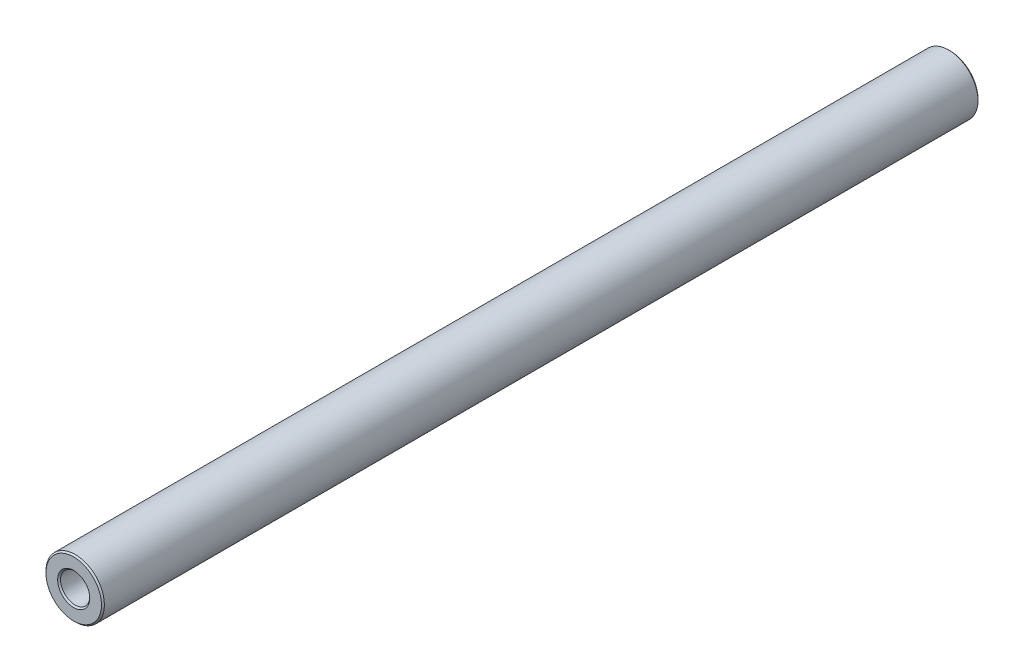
from build123d import *

# Parameters (mm, degrees)
SKETCH1_R           = 5
SKETCH1_R_2         = 2.5
BOSS_EXTRUDE1_DEPTH = 75
CHAMFER1_SIZE       = 0.25


with BuildPart() as part:
    # Sketch1 → Boss-Extrude1 (new, symmetric)
    with BuildSketch(Plane.XY):
        Circle(SKETCH1_R)
        Circle(SKETCH1_R_2, mode=Mode.SUBTRACT)
    extrude(amount=BOSS_EXTRUDE1_DEPTH, both=True)

    # Chamfer1
    chamfer1_edges = [part.edges().sort_by_distance(p)[0] for p in [
        (-5, 0, -75),
        (-5, 0, 75),
        (-2.5, 0, -75),
        (-2.5, 0, 75),
    ]]
    chamfer(chamfer1_edges, length=CHAMFER1_SIZE)


solid = part.part
